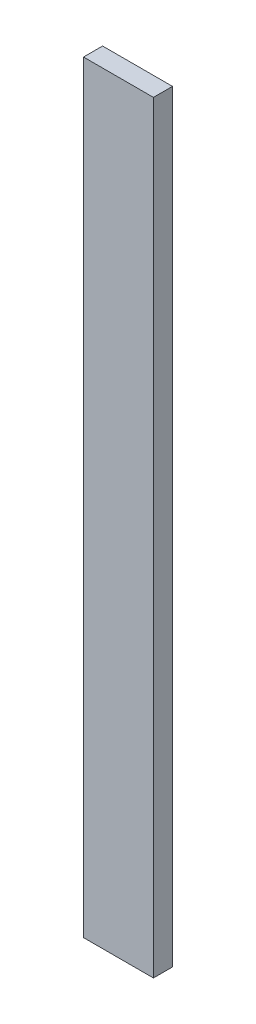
from build123d import *

# Parameters (mm, degrees)
SKETCH1_W           = 139.7
SKETCH1_H           = 38.1
BOSS_EXTRUDE1_DEPTH = 1524


with BuildPart() as part:
    # Sketch1 → Boss-Extrude1 (new body)
    with BuildSketch(Plane(origin=(0, 0, 0), x_dir=(1, 0, 0), z_dir=(0, 1, 0))):
        Rectangle(SKETCH1_W, SKETCH1_H)
    extrude(amount=BOSS_EXTRUDE1_DEPTH)


solid = part.part
